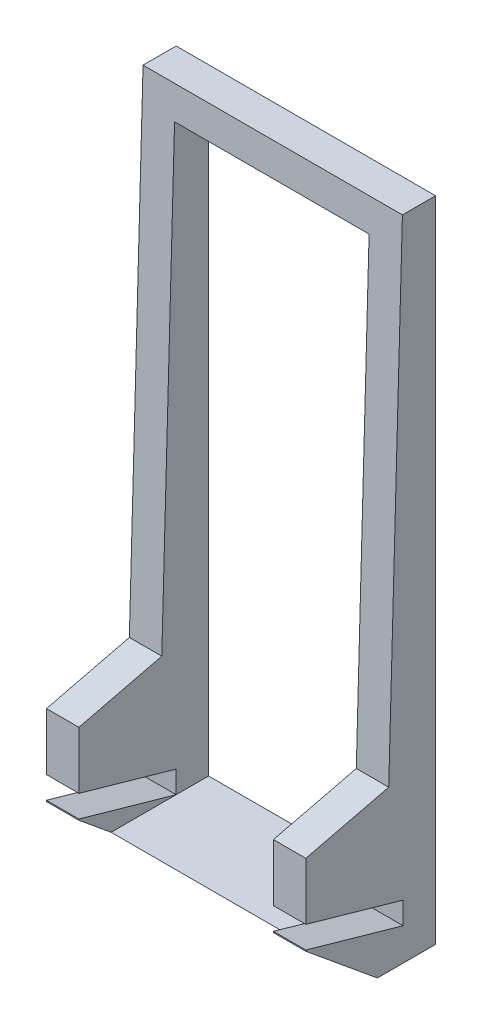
ISO-10303-21;
HEADER;
FILE_DESCRIPTION(('STEP AP214'),'2;1');
FILE_NAME('part.step','',(''),(''),'','','');
FILE_SCHEMA(('AUTOMOTIVE_DESIGN { 1 0 10303 214 1 1 1 1 }'));
ENDSEC;
DATA;
#1=APPLICATION_CONTEXT('core data for automotive mechanical design processes');
#2=APPLICATION_PROTOCOL_DEFINITION('international standard','automotive_design',2000,#1);
#3=PRODUCT_CONTEXT('',#1,'mechanical');
#4=PRODUCT('Part','Part','',(#3));
#5=PRODUCT_RELATED_PRODUCT_CATEGORY('part','',(#4));
#6=PRODUCT_DEFINITION_FORMATION('','',#4);
#7=PRODUCT_DEFINITION_CONTEXT('part definition',#1,'design');
#8=PRODUCT_DEFINITION('design','',#6,#7);
#9=PRODUCT_DEFINITION_SHAPE('','',#8);
#10=(LENGTH_UNIT() NAMED_UNIT(*) SI_UNIT(.MILLI.,.METRE.));
#11=(NAMED_UNIT(*) PLANE_ANGLE_UNIT() SI_UNIT($,.RADIAN.));
#12=(NAMED_UNIT(*) SI_UNIT($,.STERADIAN.) SOLID_ANGLE_UNIT());
#13=UNCERTAINTY_MEASURE_WITH_UNIT(LENGTH_MEASURE(1.E-05),#10,'distance_accuracy_value','');
#14=(GEOMETRIC_REPRESENTATION_CONTEXT(3) GLOBAL_UNCERTAINTY_ASSIGNED_CONTEXT((#13)) GLOBAL_UNIT_ASSIGNED_CONTEXT((#10,
#11,#12)) REPRESENTATION_CONTEXT('',''));
#15=CARTESIAN_POINT('',(0.,0.,0.));
#16=DIRECTION('',(0.,0.,1.));
#17=DIRECTION('',(1.,0.,0.));
#18=AXIS2_PLACEMENT_3D('',#15,#16,#17);
#19=CARTESIAN_POINT('',(0.,0.,20.));
#20=DIRECTION('',(0.,0.,-1.));
#21=DIRECTION('',(-1.,0.,0.));
#22=AXIS2_PLACEMENT_3D('',#19,#20,#21);
#23=PLANE('',#22);
#24=DIRECTION('',(0.,1.,0.));
#25=VECTOR('',#24,1.);
#26=CARTESIAN_POINT('',(2.32989711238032,0.,20.));
#27=LINE('',#26,#25);
#28=CARTESIAN_POINT('',(2.32989711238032,12.6839910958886,20.));
#29=VERTEX_POINT('',#28);
#30=CARTESIAN_POINT('',(2.32989711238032,21.506745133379,20.));
#31=VERTEX_POINT('',#30);
#32=EDGE_CURVE('E208',#29,#31,#27,.T.);
#33=ORIENTED_EDGE('',*,*,#32,.T.);
#34=DIRECTION('',(1.,0.,0.));
#35=VECTOR('',#34,1.);
#36=CARTESIAN_POINT('',(-37.6701028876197,21.506745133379,20.));
#37=LINE('',#36,#35);
#38=CARTESIAN_POINT('',(-2.67010288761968,21.506745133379,20.));
#39=VERTEX_POINT('',#38);
#40=EDGE_CURVE('E202',#39,#31,#37,.T.);
#41=ORIENTED_EDGE('',*,*,#40,.F.);
#42=DIRECTION('',(0.,1.,0.));
#43=VECTOR('',#42,1.);
#44=CARTESIAN_POINT('',(-2.67010288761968,5.,20.));
#45=LINE('',#44,#43);
#46=CARTESIAN_POINT('',(-2.67010288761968,12.6839910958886,20.));
#47=VERTEX_POINT('',#46);
#48=EDGE_CURVE('E333',#47,#39,#45,.T.);
#49=ORIENTED_EDGE('',*,*,#48,.F.);
#50=DIRECTION('',(1.,0.,0.));
#51=VECTOR('',#50,1.);
#52=CARTESIAN_POINT('',(-37.6701028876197,12.6839910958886,20.));
#53=LINE('',#52,#51);
#54=EDGE_CURVE('E339',#47,#29,#53,.T.);
#55=ORIENTED_EDGE('',*,*,#54,.T.);
#56=EDGE_LOOP('',(#33,#41,#49,#55));
#57=FACE_BOUND('',#56,.T.);
#58=ADVANCED_FACE('F33',(#57),#23,.F.);
#59=DIRECTION('',(0.,-1.,0.));
#60=VECTOR('',#59,1.);
#61=CARTESIAN_POINT('',(-37.6701028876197,0.,20.));
#62=LINE('',#61,#60);
#63=CARTESIAN_POINT('',(-37.6701028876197,9.25385802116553,20.));
#64=VERTEX_POINT('',#63);
#65=CARTESIAN_POINT('',(-37.6701028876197,9.08168462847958,20.));
#66=VERTEX_POINT('',#65);
#67=EDGE_CURVE('E209',#64,#66,#62,.T.);
#68=ORIENTED_EDGE('',*,*,#67,.T.);
#69=DIRECTION('',(1.,0.,0.));
#70=VECTOR('',#69,1.);
#71=CARTESIAN_POINT('',(-37.6701028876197,9.08168462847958,20.));
#72=LINE('',#71,#70);
#73=CARTESIAN_POINT('',(-32.6701028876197,9.08168462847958,20.));
#74=VERTEX_POINT('',#73);
#75=EDGE_CURVE('E363',#66,#74,#72,.T.);
#76=ORIENTED_EDGE('',*,*,#75,.T.);
#77=DIRECTION('',(0.,-1.,0.));
#78=VECTOR('',#77,1.);
#79=CARTESIAN_POINT('',(-32.6701028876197,5.,20.));
#80=LINE('',#79,#78);
#81=CARTESIAN_POINT('',(-32.6701028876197,9.25385802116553,20.));
#82=VERTEX_POINT('',#81);
#83=EDGE_CURVE('E332',#82,#74,#80,.T.);
#84=ORIENTED_EDGE('',*,*,#83,.F.);
#85=DIRECTION('',(1.,0.,0.));
#86=VECTOR('',#85,1.);
#87=CARTESIAN_POINT('',(-37.6701028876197,9.25385802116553,20.));
#88=LINE('',#87,#86);
#89=EDGE_CURVE('E300',#64,#82,#88,.T.);
#90=ORIENTED_EDGE('',*,*,#89,.F.);
#91=EDGE_LOOP('',(#68,#76,#84,#90));
#92=FACE_BOUND('',#91,.T.);
#93=ADVANCED_FACE('F428',(#92),#23,.F.);
#94=CARTESIAN_POINT('',(-32.6701028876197,21.506745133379,20.));
#95=VERTEX_POINT('',#94);
#96=CARTESIAN_POINT('',(-32.6701028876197,12.6839910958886,20.));
#97=VERTEX_POINT('',#96);
#98=EDGE_CURVE('E200',#95,#97,#80,.T.);
#99=ORIENTED_EDGE('',*,*,#98,.F.);
#100=CARTESIAN_POINT('',(-37.6701028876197,21.506745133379,20.));
#101=VERTEX_POINT('',#100);
#102=EDGE_CURVE('E184',#101,#95,#37,.T.);
#103=ORIENTED_EDGE('',*,*,#102,.F.);
#104=CARTESIAN_POINT('',(-37.6701028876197,12.6839910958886,20.));
#105=VERTEX_POINT('',#104);
#106=EDGE_CURVE('E198',#101,#105,#62,.T.);
#107=ORIENTED_EDGE('',*,*,#106,.T.);
#108=EDGE_CURVE('E302',#105,#97,#53,.T.);
#109=ORIENTED_EDGE('',*,*,#108,.T.);
#110=EDGE_LOOP('',(#99,#103,#107,#109));
#111=FACE_BOUND('',#110,.T.);
#112=ADVANCED_FACE('F196',(#111),#23,.F.);
#113=CARTESIAN_POINT('',(-32.6701028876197,5.,20.));
#114=DIRECTION('',(1.,0.,0.));
#115=DIRECTION('',(0.,0.,-1.));
#116=AXIS2_PLACEMENT_3D('',#113,#114,#115);
#117=PLANE('',#116);
#118=DIRECTION('',(0.,0.999607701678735,-0.0280079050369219));
#119=VECTOR('',#118,1.);
#120=CARTESIAN_POINT('',(-32.6701028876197,4.65756250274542,7.77833761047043));
#121=LINE('',#120,#119);
#122=CARTESIAN_POINT('',(-32.6701028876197,24.6130102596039,7.21920797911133));
#123=VERTEX_POINT('',#122);
#124=CARTESIAN_POINT('',(-32.6701028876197,95.,5.24704217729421));
#125=VERTEX_POINT('',#124);
#126=EDGE_CURVE('E55',#123,#125,#121,.T.);
#127=ORIENTED_EDGE('',*,*,#126,.F.);
#128=DIRECTION('',(0.,0.236166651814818,-0.971712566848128));
#129=VECTOR('',#128,1.);
#130=CARTESIAN_POINT('',(-32.6701028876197,20.5860865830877,23.7880686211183));
#131=LINE('',#130,#129);
#132=EDGE_CURVE('E350',#95,#123,#131,.T.);
#133=ORIENTED_EDGE('',*,*,#132,.F.);
#134=ORIENTED_EDGE('',*,*,#98,.T.);
#135=DIRECTION('',(0.,0.272831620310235,0.962061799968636));
#136=VECTOR('',#135,1.);
#137=CARTESIAN_POINT('',(-32.6701028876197,12.1120171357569,17.9830992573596));
#138=LINE('',#137,#136);
#139=CARTESIAN_POINT('',(-32.6701028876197,8.43013307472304,5.));
#140=VERTEX_POINT('',#139);
#141=EDGE_CURVE('E315',#140,#97,#138,.T.);
#142=ORIENTED_EDGE('',*,*,#141,.F.);
#143=DIRECTION('',(0.,1.,0.));
#144=VECTOR('',#143,1.);
#145=CARTESIAN_POINT('',(-32.6701028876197,5.,5.));
#146=LINE('',#145,#144);
#147=CARTESIAN_POINT('',(-32.6701028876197,5.,5.));
#148=VERTEX_POINT('',#147);
#149=EDGE_CURVE('E301',#148,#140,#146,.T.);
#150=ORIENTED_EDGE('',*,*,#149,.F.);
#151=DIRECTION('',(0.,0.,-1.));
#152=VECTOR('',#151,1.);
#153=CARTESIAN_POINT('',(-32.6701028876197,5.,20.));
#154=LINE('',#153,#152);
#155=CARTESIAN_POINT('',(-32.6701028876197,5.,0.));
#156=VERTEX_POINT('',#155);
#157=EDGE_CURVE('E274',#148,#156,#154,.T.);
#158=ORIENTED_EDGE('',*,*,#157,.T.);
#159=DIRECTION('',(0.,-1.,0.));
#160=VECTOR('',#159,1.);
#161=CARTESIAN_POINT('',(-32.6701028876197,5.,0.));
#162=LINE('',#161,#160);
#163=CARTESIAN_POINT('',(-32.6701028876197,95.,0.));
#164=VERTEX_POINT('',#163);
#165=EDGE_CURVE('E324',#164,#156,#162,.T.);
#166=ORIENTED_EDGE('',*,*,#165,.F.);
#167=DIRECTION('',(0.,0.,-1.));
#168=VECTOR('',#167,1.);
#169=CARTESIAN_POINT('',(-32.6701028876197,95.,20.));
#170=LINE('',#169,#168);
#171=EDGE_CURVE('E268',#125,#164,#170,.T.);
#172=ORIENTED_EDGE('',*,*,#171,.F.);
#173=EDGE_LOOP('',(#127,#133,#134,#142,#150,#158,#166,#172));
#174=FACE_BOUND('',#173,.T.);
#175=ADVANCED_FACE('F313',(#174),#117,.T.);
#176=CARTESIAN_POINT('',(-2.67010288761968,5.,20.));
#177=DIRECTION('',(-1.,0.,0.));
#178=DIRECTION('',(0.,-1.,0.));
#179=AXIS2_PLACEMENT_3D('',#176,#177,#178);
#180=PLANE('',#179);
#181=DIRECTION('',(0.,-0.999607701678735,0.0280079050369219));
#182=VECTOR('',#181,1.);
#183=CARTESIAN_POINT('',(-2.67010288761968,4.65756250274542,7.77833761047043));
#184=LINE('',#183,#182);
#185=CARTESIAN_POINT('',(-2.67010288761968,95.,5.24704217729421));
#186=VERTEX_POINT('',#185);
#187=CARTESIAN_POINT('',(-2.67010288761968,24.6130102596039,7.21920797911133));
#188=VERTEX_POINT('',#187);
#189=EDGE_CURVE('E248',#186,#188,#184,.T.);
#190=ORIENTED_EDGE('',*,*,#189,.F.);
#191=DIRECTION('',(0.,0.,-1.));
#192=VECTOR('',#191,1.);
#193=CARTESIAN_POINT('',(-2.67010288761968,95.,20.));
#194=LINE('',#193,#192);
#195=CARTESIAN_POINT('',(-2.67010288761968,95.,0.));
#196=VERTEX_POINT('',#195);
#197=EDGE_CURVE('E257',#186,#196,#194,.T.);
#198=ORIENTED_EDGE('',*,*,#197,.T.);
#199=DIRECTION('',(0.,1.,0.));
#200=VECTOR('',#199,1.);
#201=CARTESIAN_POINT('',(-2.67010288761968,5.,0.));
#202=LINE('',#201,#200);
#203=CARTESIAN_POINT('',(-2.67010288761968,5.,0.));
#204=VERTEX_POINT('',#203);
#205=EDGE_CURVE('E323',#204,#196,#202,.T.);
#206=ORIENTED_EDGE('',*,*,#205,.F.);
#207=DIRECTION('',(0.,0.,-1.));
#208=VECTOR('',#207,1.);
#209=CARTESIAN_POINT('',(-2.67010288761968,5.,20.));
#210=LINE('',#209,#208);
#211=CARTESIAN_POINT('',(-2.67010288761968,5.,5.));
#212=VERTEX_POINT('',#211);
#213=EDGE_CURVE('E267',#212,#204,#210,.T.);
#214=ORIENTED_EDGE('',*,*,#213,.F.);
#215=DIRECTION('',(0.,-1.,0.));
#216=VECTOR('',#215,1.);
#217=CARTESIAN_POINT('',(-2.67010288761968,5.,5.));
#218=LINE('',#217,#216);
#219=CARTESIAN_POINT('',(-2.67010288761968,8.43013307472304,5.));
#220=VERTEX_POINT('',#219);
#221=EDGE_CURVE('E242',#220,#212,#218,.T.);
#222=ORIENTED_EDGE('',*,*,#221,.F.);
#223=DIRECTION('',(0.,-0.272831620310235,-0.962061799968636));
#224=VECTOR('',#223,1.);
#225=CARTESIAN_POINT('',(-2.67010288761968,12.1120171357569,17.9830992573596));
#226=LINE('',#225,#224);
#227=EDGE_CURVE('E245',#47,#220,#226,.T.);
#228=ORIENTED_EDGE('',*,*,#227,.F.);
#229=ORIENTED_EDGE('',*,*,#48,.T.);
#230=DIRECTION('',(0.,-0.236166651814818,0.971712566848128));
#231=VECTOR('',#230,1.);
#232=CARTESIAN_POINT('',(-2.67010288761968,20.5860865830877,23.7880686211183));
#233=LINE('',#232,#231);
#234=EDGE_CURVE('E260',#188,#39,#233,.T.);
#235=ORIENTED_EDGE('',*,*,#234,.F.);
#236=EDGE_LOOP('',(#190,#198,#206,#214,#222,#228,#229,#235));
#237=FACE_BOUND('',#236,.T.);
#238=ADVANCED_FACE('F255',(#237),#180,.T.);
#239=CARTESIAN_POINT('',(-2.67010288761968,9.08168462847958,20.));
#240=VERTEX_POINT('',#239);
#241=CARTESIAN_POINT('',(-2.67010288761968,9.25385802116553,20.));
#242=VERTEX_POINT('',#241);
#243=EDGE_CURVE('E271',#240,#242,#45,.T.);
#244=ORIENTED_EDGE('',*,*,#243,.F.);
#245=CARTESIAN_POINT('',(2.32989711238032,9.08168462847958,20.));
#246=VERTEX_POINT('',#245);
#247=EDGE_CURVE('E47',#240,#246,#72,.T.);
#248=ORIENTED_EDGE('',*,*,#247,.T.);
#249=CARTESIAN_POINT('',(2.32989711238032,9.25385802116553,20.));
#250=VERTEX_POINT('',#249);
#251=EDGE_CURVE('E212',#246,#250,#27,.T.);
#252=ORIENTED_EDGE('',*,*,#251,.T.);
#253=EDGE_CURVE('E335',#242,#250,#88,.T.);
#254=ORIENTED_EDGE('',*,*,#253,.F.);
#255=EDGE_LOOP('',(#244,#248,#252,#254));
#256=FACE_BOUND('',#255,.T.);
#257=ADVANCED_FACE('F408',(#256),#23,.F.);
#258=CARTESIAN_POINT('',(0.,0.,0.));
#259=DIRECTION('',(0.,0.,-1.));
#260=DIRECTION('',(-1.,0.,0.));
#261=AXIS2_PLACEMENT_3D('',#258,#259,#260);
#262=PLANE('',#261);
#263=DIRECTION('',(0.,-1.,0.));
#264=VECTOR('',#263,1.);
#265=CARTESIAN_POINT('',(-37.6701028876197,0.,0.));
#266=LINE('',#265,#264);
#267=CARTESIAN_POINT('',(-37.6701028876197,100.,0.));
#268=VERTEX_POINT('',#267);
#269=CARTESIAN_POINT('',(-37.6701028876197,0.,0.));
#270=VERTEX_POINT('',#269);
#271=EDGE_CURVE('E221',#268,#270,#266,.T.);
#272=ORIENTED_EDGE('',*,*,#271,.F.);
#273=DIRECTION('',(-1.,0.,0.));
#274=VECTOR('',#273,1.);
#275=CARTESIAN_POINT('',(-37.6701028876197,100.,0.));
#276=LINE('',#275,#274);
#277=CARTESIAN_POINT('',(2.32989711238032,100.,0.));
#278=VERTEX_POINT('',#277);
#279=EDGE_CURVE('E215',#278,#268,#276,.T.);
#280=ORIENTED_EDGE('',*,*,#279,.F.);
#281=DIRECTION('',(0.,1.,0.));
#282=VECTOR('',#281,1.);
#283=CARTESIAN_POINT('',(2.32989711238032,0.,0.));
#284=LINE('',#283,#282);
#285=CARTESIAN_POINT('',(2.32989711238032,0.,0.));
#286=VERTEX_POINT('',#285);
#287=EDGE_CURVE('E227',#286,#278,#284,.T.);
#288=ORIENTED_EDGE('',*,*,#287,.F.);
#289=DIRECTION('',(1.,0.,0.));
#290=VECTOR('',#289,1.);
#291=CARTESIAN_POINT('',(-37.6701028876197,0.,0.));
#292=LINE('',#291,#290);
#293=EDGE_CURVE('E224',#270,#286,#292,.T.);
#294=ORIENTED_EDGE('',*,*,#293,.F.);
#295=EDGE_LOOP('',(#272,#280,#288,#294));
#296=FACE_BOUND('',#295,.T.);
#297=DIRECTION('',(-1.,0.,0.));
#298=VECTOR('',#297,1.);
#299=CARTESIAN_POINT('',(-32.6701028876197,95.,0.));
#300=LINE('',#299,#298);
#301=EDGE_CURVE('E265',#196,#164,#300,.T.);
#302=ORIENTED_EDGE('',*,*,#301,.T.);
#303=ORIENTED_EDGE('',*,*,#165,.T.);
#304=DIRECTION('',(1.,0.,0.));
#305=VECTOR('',#304,1.);
#306=CARTESIAN_POINT('',(-32.6701028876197,5.,0.));
#307=LINE('',#306,#305);
#308=EDGE_CURVE('E319',#156,#204,#307,.T.);
#309=ORIENTED_EDGE('',*,*,#308,.T.);
#310=ORIENTED_EDGE('',*,*,#205,.T.);
#311=EDGE_LOOP('',(#302,#303,#309,#310));
#312=FACE_BOUND('',#311,.T.);
#313=ADVANCED_FACE('F326',(#296,#312),#262,.T.);
#314=CARTESIAN_POINT('',(-37.6701028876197,0.,20.));
#315=DIRECTION('',(1.,0.,0.));
#316=DIRECTION('',(0.,0.,-1.));
#317=AXIS2_PLACEMENT_3D('',#314,#315,#316);
#318=PLANE('',#317);
#319=DIRECTION('',(0.,0.236166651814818,-0.971712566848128));
#320=VECTOR('',#319,1.);
#321=CARTESIAN_POINT('',(-37.6701028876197,21.506745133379,20.));
#322=LINE('',#321,#320);
#323=CARTESIAN_POINT('',(-37.6701028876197,24.6130102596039,7.21920797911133));
#324=VERTEX_POINT('',#323);
#325=EDGE_CURVE('E181',#101,#324,#322,.T.);
#326=ORIENTED_EDGE('',*,*,#325,.T.);
#327=DIRECTION('',(0.,0.999607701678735,-0.0280079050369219));
#328=VECTOR('',#327,1.);
#329=CARTESIAN_POINT('',(-37.6701028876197,24.6130102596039,7.21920797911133));
#330=LINE('',#329,#328);
#331=CARTESIAN_POINT('',(-37.6701028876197,100.,5.1069476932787));
#332=VERTEX_POINT('',#331);
#333=EDGE_CURVE('E191',#324,#332,#330,.T.);
#334=ORIENTED_EDGE('',*,*,#333,.T.);
#335=DIRECTION('',(0.,0.,-1.));
#336=VECTOR('',#335,1.);
#337=CARTESIAN_POINT('',(-37.6701028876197,100.,20.));
#338=LINE('',#337,#336);
#339=EDGE_CURVE('E220',#332,#268,#338,.T.);
#340=ORIENTED_EDGE('',*,*,#339,.T.);
#341=ORIENTED_EDGE('',*,*,#271,.T.);
#342=DIRECTION('',(0.,0.,-1.));
#343=VECTOR('',#342,1.);
#344=CARTESIAN_POINT('',(-37.6701028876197,0.,20.));
#345=LINE('',#344,#343);
#346=CARTESIAN_POINT('',(-37.6701028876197,0.,8.95871644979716));
#347=VERTEX_POINT('',#346);
#348=EDGE_CURVE('E237',#347,#270,#345,.T.);
#349=ORIENTED_EDGE('',*,*,#348,.F.);
#350=DIRECTION('',(0.,0.635242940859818,0.772312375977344));
#351=VECTOR('',#350,1.);
#352=CARTESIAN_POINT('',(-37.6701028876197,9.08168462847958,20.));
#353=LINE('',#352,#351);
#354=EDGE_CURVE('E362',#347,#66,#353,.T.);
#355=ORIENTED_EDGE('',*,*,#354,.T.);
#356=ORIENTED_EDGE('',*,*,#67,.F.);
#357=DIRECTION('',(0.,-0.272831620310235,-0.962061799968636));
#358=VECTOR('',#357,1.);
#359=CARTESIAN_POINT('',(-37.6701028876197,9.25385802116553,20.));
#360=LINE('',#359,#358);
#361=CARTESIAN_POINT('',(-37.6701028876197,5.,5.));
#362=VERTEX_POINT('',#361);
#363=EDGE_CURVE('E343',#64,#362,#360,.T.);
#364=ORIENTED_EDGE('',*,*,#363,.T.);
#365=DIRECTION('',(0.,1.,0.));
#366=VECTOR('',#365,1.);
#367=CARTESIAN_POINT('',(-37.6701028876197,5.,5.));
#368=LINE('',#367,#366);
#369=CARTESIAN_POINT('',(-37.6701028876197,8.43013307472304,5.));
#370=VERTEX_POINT('',#369);
#371=EDGE_CURVE('E307',#362,#370,#368,.T.);
#372=ORIENTED_EDGE('',*,*,#371,.T.);
#373=DIRECTION('',(0.,0.272831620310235,0.962061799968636));
#374=VECTOR('',#373,1.);
#375=CARTESIAN_POINT('',(-37.6701028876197,8.43013307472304,5.));
#376=LINE('',#375,#374);
#377=EDGE_CURVE('E207',#370,#105,#376,.T.);
#378=ORIENTED_EDGE('',*,*,#377,.T.);
#379=ORIENTED_EDGE('',*,*,#106,.F.);
#380=EDGE_LOOP('',(#326,#334,#340,#341,#349,#355,#356,#364,#372,#378,#379));
#381=FACE_BOUND('',#380,.T.);
#382=ADVANCED_FACE('F35',(#381),#318,.F.);
#383=CARTESIAN_POINT('',(-37.6701028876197,0.,20.));
#384=DIRECTION('',(0.,1.,0.));
#385=DIRECTION('',(0.,0.,1.));
#386=AXIS2_PLACEMENT_3D('',#383,#384,#385);
#387=PLANE('',#386);
#388=DIRECTION('',(0.,0.,-1.));
#389=VECTOR('',#388,1.);
#390=CARTESIAN_POINT('',(2.32989711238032,0.,20.));
#391=LINE('',#390,#389);
#392=CARTESIAN_POINT('',(2.32989711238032,0.,8.95871644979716));
#393=VERTEX_POINT('',#392);
#394=EDGE_CURVE('E235',#393,#286,#391,.T.);
#395=ORIENTED_EDGE('',*,*,#394,.F.);
#396=DIRECTION('',(1.,0.,0.));
#397=VECTOR('',#396,1.);
#398=CARTESIAN_POINT('',(-37.6701028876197,0.,8.95871644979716));
#399=LINE('',#398,#397);
#400=EDGE_CURVE('E360',#347,#393,#399,.T.);
#401=ORIENTED_EDGE('',*,*,#400,.F.);
#402=ORIENTED_EDGE('',*,*,#348,.T.);
#403=ORIENTED_EDGE('',*,*,#293,.T.);
#404=EDGE_LOOP('',(#395,#401,#402,#403));
#405=FACE_BOUND('',#404,.T.);
#406=ADVANCED_FACE('F415',(#405),#387,.F.);
#407=CARTESIAN_POINT('',(2.32989711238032,0.,20.));
#408=DIRECTION('',(-1.,0.,0.));
#409=DIRECTION('',(0.,0.,1.));
#410=AXIS2_PLACEMENT_3D('',#407,#408,#409);
#411=PLANE('',#410);
#412=DIRECTION('',(0.,0.,-1.));
#413=VECTOR('',#412,1.);
#414=CARTESIAN_POINT('',(2.32989711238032,100.,20.));
#415=LINE('',#414,#413);
#416=CARTESIAN_POINT('',(2.32989711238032,100.,5.1069476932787));
#417=VERTEX_POINT('',#416);
#418=EDGE_CURVE('E233',#417,#278,#415,.T.);
#419=ORIENTED_EDGE('',*,*,#418,.F.);
#420=DIRECTION('',(0.,0.999607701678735,-0.0280079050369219));
#421=VECTOR('',#420,1.);
#422=CARTESIAN_POINT('',(2.32989711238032,24.6130102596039,7.21920797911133));
#423=LINE('',#422,#421);
#424=CARTESIAN_POINT('',(2.32989711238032,24.6130102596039,7.21920797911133));
#425=VERTEX_POINT('',#424);
#426=EDGE_CURVE('E192',#425,#417,#423,.T.);
#427=ORIENTED_EDGE('',*,*,#426,.F.);
#428=DIRECTION('',(0.,0.236166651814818,-0.971712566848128));
#429=VECTOR('',#428,1.);
#430=CARTESIAN_POINT('',(2.32989711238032,21.506745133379,20.));
#431=LINE('',#430,#429);
#432=EDGE_CURVE('E366',#31,#425,#431,.T.);
#433=ORIENTED_EDGE('',*,*,#432,.F.);
#434=ORIENTED_EDGE('',*,*,#32,.F.);
#435=DIRECTION('',(0.,0.272831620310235,0.962061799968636));
#436=VECTOR('',#435,1.);
#437=CARTESIAN_POINT('',(2.32989711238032,8.43013307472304,5.));
#438=LINE('',#437,#436);
#439=CARTESIAN_POINT('',(2.32989711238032,8.43013307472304,5.));
#440=VERTEX_POINT('',#439);
#441=EDGE_CURVE('E341',#440,#29,#438,.T.);
#442=ORIENTED_EDGE('',*,*,#441,.F.);
#443=DIRECTION('',(0.,1.,0.));
#444=VECTOR('',#443,1.);
#445=CARTESIAN_POINT('',(2.32989711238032,5.,5.));
#446=LINE('',#445,#444);
#447=CARTESIAN_POINT('',(2.32989711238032,5.,5.));
#448=VERTEX_POINT('',#447);
#449=EDGE_CURVE('E344',#448,#440,#446,.T.);
#450=ORIENTED_EDGE('',*,*,#449,.F.);
#451=DIRECTION('',(0.,-0.272831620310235,-0.962061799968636));
#452=VECTOR('',#451,1.);
#453=CARTESIAN_POINT('',(2.32989711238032,9.25385802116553,20.));
#454=LINE('',#453,#452);
#455=EDGE_CURVE('E347',#250,#448,#454,.T.);
#456=ORIENTED_EDGE('',*,*,#455,.F.);
#457=ORIENTED_EDGE('',*,*,#251,.F.);
#458=DIRECTION('',(0.,0.635242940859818,0.772312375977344));
#459=VECTOR('',#458,1.);
#460=CARTESIAN_POINT('',(2.32989711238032,9.08168462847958,20.));
#461=LINE('',#460,#459);
#462=EDGE_CURVE('E367',#393,#246,#461,.T.);
#463=ORIENTED_EDGE('',*,*,#462,.F.);
#464=ORIENTED_EDGE('',*,*,#394,.T.);
#465=ORIENTED_EDGE('',*,*,#287,.T.);
#466=EDGE_LOOP('',(#419,#427,#433,#434,#442,#450,#456,#457,#463,#464,#465));
#467=FACE_BOUND('',#466,.T.);
#468=ADVANCED_FACE('F388',(#467),#411,.F.);
#469=CARTESIAN_POINT('',(-37.6701028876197,100.,20.));
#470=DIRECTION('',(0.,-1.,0.));
#471=DIRECTION('',(0.,0.,-1.));
#472=AXIS2_PLACEMENT_3D('',#469,#470,#471);
#473=PLANE('',#472);
#474=ORIENTED_EDGE('',*,*,#339,.F.);
#475=DIRECTION('',(1.,0.,0.));
#476=VECTOR('',#475,1.);
#477=CARTESIAN_POINT('',(-37.6701028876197,100.,5.1069476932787));
#478=LINE('',#477,#476);
#479=EDGE_CURVE('E261',#332,#417,#478,.T.);
#480=ORIENTED_EDGE('',*,*,#479,.T.);
#481=ORIENTED_EDGE('',*,*,#418,.T.);
#482=ORIENTED_EDGE('',*,*,#279,.T.);
#483=EDGE_LOOP('',(#474,#480,#481,#482));
#484=FACE_BOUND('',#483,.T.);
#485=ADVANCED_FACE('F423',(#484),#473,.F.);
#486=DIRECTION('',(0.,0.635242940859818,0.772312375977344));
#487=VECTOR('',#486,1.);
#488=CARTESIAN_POINT('',(-32.6701028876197,7.43458776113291,17.9975010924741));
#489=LINE('',#488,#487);
#490=CARTESIAN_POINT('',(-32.6701028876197,5.,15.0375905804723));
#491=VERTEX_POINT('',#490);
#492=EDGE_CURVE('E293',#491,#74,#489,.T.);
#493=ORIENTED_EDGE('',*,*,#492,.F.);
#494=EDGE_CURVE('E217',#491,#148,#154,.T.);
#495=ORIENTED_EDGE('',*,*,#494,.T.);
#496=DIRECTION('',(0.,-0.272831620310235,-0.962061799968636));
#497=VECTOR('',#496,1.);
#498=CARTESIAN_POINT('',(-32.6701028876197,8.93721319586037,18.8834436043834));
#499=LINE('',#498,#497);
#500=EDGE_CURVE('E291',#82,#148,#499,.T.);
#501=ORIENTED_EDGE('',*,*,#500,.F.);
#502=ORIENTED_EDGE('',*,*,#83,.T.);
#503=EDGE_LOOP('',(#493,#495,#501,#502));
#504=FACE_BOUND('',#503,.T.);
#505=ADVANCED_FACE('F289',(#504),#117,.T.);
#506=CARTESIAN_POINT('',(-32.6701028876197,5.,20.));
#507=DIRECTION('',(0.,1.,0.));
#508=DIRECTION('',(0.,0.,1.));
#509=AXIS2_PLACEMENT_3D('',#506,#507,#508);
#510=PLANE('',#509);
#511=DIRECTION('',(-1.,0.,0.));
#512=VECTOR('',#511,1.);
#513=CARTESIAN_POINT('',(-32.6701028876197,5.,15.0375905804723));
#514=LINE('',#513,#512);
#515=CARTESIAN_POINT('',(-2.67010288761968,5.,15.0375905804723));
#516=VERTEX_POINT('',#515);
#517=EDGE_CURVE('E357',#516,#491,#514,.T.);
#518=ORIENTED_EDGE('',*,*,#517,.F.);
#519=EDGE_CURVE('E270',#516,#212,#210,.T.);
#520=ORIENTED_EDGE('',*,*,#519,.T.);
#521=ORIENTED_EDGE('',*,*,#213,.T.);
#522=ORIENTED_EDGE('',*,*,#308,.F.);
#523=ORIENTED_EDGE('',*,*,#157,.F.);
#524=ORIENTED_EDGE('',*,*,#494,.F.);
#525=EDGE_LOOP('',(#518,#520,#521,#522,#523,#524));
#526=FACE_BOUND('',#525,.T.);
#527=ADVANCED_FACE('F317',(#526),#510,.T.);
#528=DIRECTION('',(0.,-0.635242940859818,-0.772312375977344));
#529=VECTOR('',#528,1.);
#530=CARTESIAN_POINT('',(-2.67010288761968,7.43458776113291,17.9975010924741));
#531=LINE('',#530,#529);
#532=EDGE_CURVE('E11',#240,#516,#531,.T.);
#533=ORIENTED_EDGE('',*,*,#532,.F.);
#534=ORIENTED_EDGE('',*,*,#243,.T.);
#535=DIRECTION('',(0.,0.272831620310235,0.962061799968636));
#536=VECTOR('',#535,1.);
#537=CARTESIAN_POINT('',(-2.67010288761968,8.93721319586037,18.8834436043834));
#538=LINE('',#537,#536);
#539=EDGE_CURVE('E239',#212,#242,#538,.T.);
#540=ORIENTED_EDGE('',*,*,#539,.F.);
#541=ORIENTED_EDGE('',*,*,#519,.F.);
#542=EDGE_LOOP('',(#533,#534,#540,#541));
#543=FACE_BOUND('',#542,.T.);
#544=ADVANCED_FACE('F400',(#543),#180,.T.);
#545=CARTESIAN_POINT('',(-32.6701028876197,95.,20.));
#546=DIRECTION('',(0.,-1.,0.));
#547=DIRECTION('',(0.,0.,-1.));
#548=AXIS2_PLACEMENT_3D('',#545,#546,#547);
#549=PLANE('',#548);
#550=DIRECTION('',(1.,0.,0.));
#551=VECTOR('',#550,1.);
#552=CARTESIAN_POINT('',(-32.6701028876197,95.,5.24704217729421));
#553=LINE('',#552,#551);
#554=EDGE_CURVE('E41',#125,#186,#553,.T.);
#555=ORIENTED_EDGE('',*,*,#554,.F.);
#556=ORIENTED_EDGE('',*,*,#171,.T.);
#557=ORIENTED_EDGE('',*,*,#301,.F.);
#558=ORIENTED_EDGE('',*,*,#197,.F.);
#559=EDGE_LOOP('',(#555,#556,#557,#558));
#560=FACE_BOUND('',#559,.T.);
#561=ADVANCED_FACE('F263',(#560),#549,.T.);
#562=CARTESIAN_POINT('',(-37.6701028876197,9.25385802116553,20.));
#563=DIRECTION('',(0.,-0.962061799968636,0.272831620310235));
#564=DIRECTION('',(0.,-0.272831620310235,-0.962061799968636));
#565=AXIS2_PLACEMENT_3D('',#562,#563,#564);
#566=PLANE('',#565);
#567=ORIENTED_EDGE('',*,*,#539,.T.);
#568=ORIENTED_EDGE('',*,*,#253,.T.);
#569=ORIENTED_EDGE('',*,*,#455,.T.);
#570=DIRECTION('',(1.,0.,0.));
#571=VECTOR('',#570,1.);
#572=CARTESIAN_POINT('',(-37.6701028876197,5.,5.));
#573=LINE('',#572,#571);
#574=EDGE_CURVE('E310',#212,#448,#573,.T.);
#575=ORIENTED_EDGE('',*,*,#574,.F.);
#576=EDGE_LOOP('',(#567,#568,#569,#575));
#577=FACE_BOUND('',#576,.T.);
#578=ADVANCED_FACE('F405',(#577),#566,.F.);
#579=CARTESIAN_POINT('',(-37.6701028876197,5.,5.));
#580=DIRECTION('',(0.,0.,-1.));
#581=DIRECTION('',(-1.,0.,0.));
#582=AXIS2_PLACEMENT_3D('',#579,#580,#581);
#583=PLANE('',#582);
#584=ORIENTED_EDGE('',*,*,#221,.T.);
#585=ORIENTED_EDGE('',*,*,#574,.T.);
#586=ORIENTED_EDGE('',*,*,#449,.T.);
#587=DIRECTION('',(1.,0.,0.));
#588=VECTOR('',#587,1.);
#589=CARTESIAN_POINT('',(-37.6701028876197,8.43013307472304,5.));
#590=LINE('',#589,#588);
#591=EDGE_CURVE('E309',#220,#440,#590,.T.);
#592=ORIENTED_EDGE('',*,*,#591,.F.);
#593=EDGE_LOOP('',(#584,#585,#586,#592));
#594=FACE_BOUND('',#593,.T.);
#595=ADVANCED_FACE('F398',(#594),#583,.F.);
#596=CARTESIAN_POINT('',(-37.6701028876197,8.43013307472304,5.));
#597=DIRECTION('',(0.,0.962061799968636,-0.272831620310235));
#598=DIRECTION('',(0.,0.272831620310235,0.962061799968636));
#599=AXIS2_PLACEMENT_3D('',#596,#597,#598);
#600=PLANE('',#599);
#601=ORIENTED_EDGE('',*,*,#227,.T.);
#602=ORIENTED_EDGE('',*,*,#591,.T.);
#603=ORIENTED_EDGE('',*,*,#441,.T.);
#604=ORIENTED_EDGE('',*,*,#54,.F.);
#605=EDGE_LOOP('',(#601,#602,#603,#604));
#606=FACE_BOUND('',#605,.T.);
#607=ADVANCED_FACE('F393',(#606),#600,.F.);
#608=ORIENTED_EDGE('',*,*,#141,.T.);
#609=ORIENTED_EDGE('',*,*,#108,.F.);
#610=ORIENTED_EDGE('',*,*,#377,.F.);
#611=EDGE_CURVE('E337',#370,#140,#590,.T.);
#612=ORIENTED_EDGE('',*,*,#611,.T.);
#613=EDGE_LOOP('',(#608,#609,#610,#612));
#614=FACE_BOUND('',#613,.T.);
#615=ADVANCED_FACE('F425',(#614),#600,.F.);
#616=ORIENTED_EDGE('',*,*,#149,.T.);
#617=ORIENTED_EDGE('',*,*,#611,.F.);
#618=ORIENTED_EDGE('',*,*,#371,.F.);
#619=EDGE_CURVE('E297',#362,#148,#573,.T.);
#620=ORIENTED_EDGE('',*,*,#619,.T.);
#621=EDGE_LOOP('',(#616,#617,#618,#620));
#622=FACE_BOUND('',#621,.T.);
#623=ADVANCED_FACE('F305',(#622),#583,.F.);
#624=ORIENTED_EDGE('',*,*,#500,.T.);
#625=ORIENTED_EDGE('',*,*,#619,.F.);
#626=ORIENTED_EDGE('',*,*,#363,.F.);
#627=ORIENTED_EDGE('',*,*,#89,.T.);
#628=EDGE_LOOP('',(#624,#625,#626,#627));
#629=FACE_BOUND('',#628,.T.);
#630=ADVANCED_FACE('F296',(#629),#566,.F.);
#631=CARTESIAN_POINT('',(-37.6701028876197,21.506745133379,20.));
#632=DIRECTION('',(0.,-0.971712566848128,-0.236166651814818));
#633=DIRECTION('',(0.,0.236166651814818,-0.971712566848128));
#634=AXIS2_PLACEMENT_3D('',#631,#632,#633);
#635=PLANE('',#634);
#636=ORIENTED_EDGE('',*,*,#132,.T.);
#637=DIRECTION('',(1.,0.,0.));
#638=VECTOR('',#637,1.);
#639=CARTESIAN_POINT('',(-37.6701028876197,24.6130102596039,7.21920797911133));
#640=LINE('',#639,#638);
#641=EDGE_CURVE('E186',#324,#123,#640,.T.);
#642=ORIENTED_EDGE('',*,*,#641,.F.);
#643=ORIENTED_EDGE('',*,*,#325,.F.);
#644=ORIENTED_EDGE('',*,*,#102,.T.);
#645=EDGE_LOOP('',(#636,#642,#643,#644));
#646=FACE_BOUND('',#645,.T.);
#647=ADVANCED_FACE('F183',(#646),#635,.F.);
#648=CARTESIAN_POINT('',(-37.6701028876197,24.6130102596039,7.21920797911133));
#649=DIRECTION('',(0.,-0.0280079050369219,-0.999607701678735));
#650=DIRECTION('',(0.,0.999607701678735,-0.0280079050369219));
#651=AXIS2_PLACEMENT_3D('',#648,#649,#650);
#652=PLANE('',#651);
#653=ORIENTED_EDGE('',*,*,#126,.T.);
#654=ORIENTED_EDGE('',*,*,#554,.T.);
#655=ORIENTED_EDGE('',*,*,#189,.T.);
#656=EDGE_CURVE('E201',#188,#425,#640,.T.);
#657=ORIENTED_EDGE('',*,*,#656,.T.);
#658=ORIENTED_EDGE('',*,*,#426,.T.);
#659=ORIENTED_EDGE('',*,*,#479,.F.);
#660=ORIENTED_EDGE('',*,*,#333,.F.);
#661=ORIENTED_EDGE('',*,*,#641,.T.);
#662=EDGE_LOOP('',(#653,#654,#655,#657,#658,#659,#660,#661));
#663=FACE_BOUND('',#662,.T.);
#664=ADVANCED_FACE('F247',(#663),#652,.F.);
#665=ORIENTED_EDGE('',*,*,#234,.T.);
#666=ORIENTED_EDGE('',*,*,#40,.T.);
#667=ORIENTED_EDGE('',*,*,#432,.T.);
#668=ORIENTED_EDGE('',*,*,#656,.F.);
#669=EDGE_LOOP('',(#665,#666,#667,#668));
#670=FACE_BOUND('',#669,.T.);
#671=ADVANCED_FACE('F381',(#670),#635,.F.);
#672=CARTESIAN_POINT('',(-37.6701028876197,9.08168462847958,20.));
#673=DIRECTION('',(0.,0.772312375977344,-0.635242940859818));
#674=DIRECTION('',(0.,0.635242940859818,0.772312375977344));
#675=AXIS2_PLACEMENT_3D('',#672,#673,#674);
#676=PLANE('',#675);
#677=ORIENTED_EDGE('',*,*,#492,.T.);
#678=ORIENTED_EDGE('',*,*,#75,.F.);
#679=ORIENTED_EDGE('',*,*,#354,.F.);
#680=ORIENTED_EDGE('',*,*,#400,.T.);
#681=ORIENTED_EDGE('',*,*,#462,.T.);
#682=ORIENTED_EDGE('',*,*,#247,.F.);
#683=ORIENTED_EDGE('',*,*,#532,.T.);
#684=ORIENTED_EDGE('',*,*,#517,.T.);
#685=EDGE_LOOP('',(#677,#678,#679,#680,#681,#682,#683,#684));
#686=FACE_BOUND('',#685,.T.);
#687=ADVANCED_FACE('F429',(#686),#676,.F.);
#688=CLOSED_SHELL('',(#58,#93,#112,#175,#238,#257,#313,#382,#406,#468,#485,#505,#527,#544,#561,
#578,#595,#607,#615,#623,#630,#647,#664,#671,#687));
#689=MANIFOLD_SOLID_BREP('B2',#688);
#690=ADVANCED_BREP_SHAPE_REPRESENTATION('',(#18,#689),#14);
#691=SHAPE_DEFINITION_REPRESENTATION(#9,#690);
ENDSEC;
END-ISO-10303-21;
